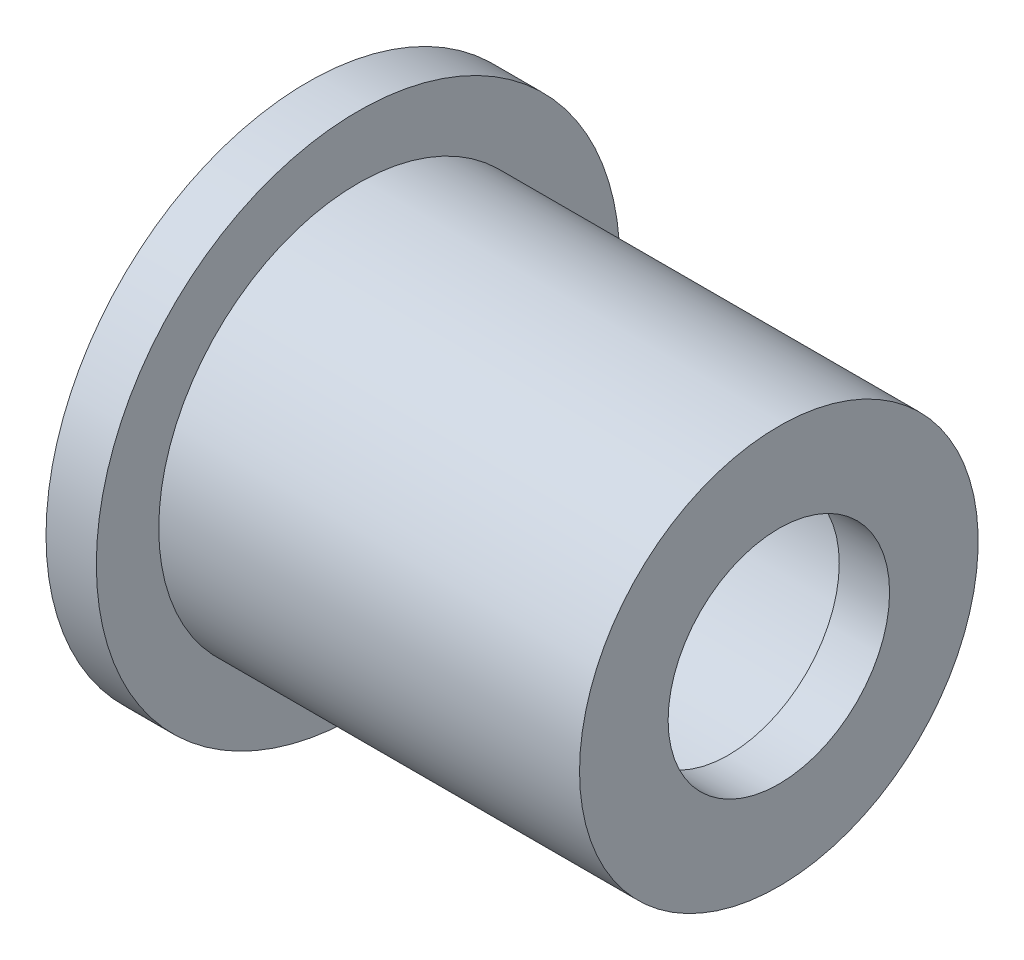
ISO-10303-21;
HEADER;
FILE_DESCRIPTION(('STEP AP214'),'2;1');
FILE_NAME('part.step','',(''),(''),'','','');
FILE_SCHEMA(('AUTOMOTIVE_DESIGN { 1 0 10303 214 1 1 1 1 }'));
ENDSEC;
DATA;
#1=APPLICATION_CONTEXT('core data for automotive mechanical design processes');
#2=APPLICATION_PROTOCOL_DEFINITION('international standard','automotive_design',2000,#1);
#3=PRODUCT_CONTEXT('',#1,'mechanical');
#4=PRODUCT('Part','Part','',(#3));
#5=PRODUCT_RELATED_PRODUCT_CATEGORY('part','',(#4));
#6=PRODUCT_DEFINITION_FORMATION('','',#4);
#7=PRODUCT_DEFINITION_CONTEXT('part definition',#1,'design');
#8=PRODUCT_DEFINITION('design','',#6,#7);
#9=PRODUCT_DEFINITION_SHAPE('','',#8);
#10=(LENGTH_UNIT() NAMED_UNIT(*) SI_UNIT(.MILLI.,.METRE.));
#11=(NAMED_UNIT(*) PLANE_ANGLE_UNIT() SI_UNIT($,.RADIAN.));
#12=(NAMED_UNIT(*) SI_UNIT($,.STERADIAN.) SOLID_ANGLE_UNIT());
#13=UNCERTAINTY_MEASURE_WITH_UNIT(LENGTH_MEASURE(1.E-05),#10,'distance_accuracy_value','');
#14=(GEOMETRIC_REPRESENTATION_CONTEXT(3) GLOBAL_UNCERTAINTY_ASSIGNED_CONTEXT((#13)) GLOBAL_UNIT_ASSIGNED_CONTEXT((#10,
#11,#12)) REPRESENTATION_CONTEXT('',''));
#15=CARTESIAN_POINT('',(0.,0.,0.));
#16=DIRECTION('',(0.,0.,1.));
#17=DIRECTION('',(1.,0.,0.));
#18=AXIS2_PLACEMENT_3D('',#15,#16,#17);
#19=CARTESIAN_POINT('',(0.,0.,0.));
#20=DIRECTION('',(-1.,0.,0.));
#21=DIRECTION('',(0.,0.,1.));
#22=AXIS2_PLACEMENT_3D('',#19,#20,#21);
#23=CYLINDRICAL_SURFACE('',#22,13.);
#24=CARTESIAN_POINT('',(0.,0.,0.));
#25=DIRECTION('',(-1.,0.,0.));
#26=DIRECTION('',(0.,0.,1.));
#27=AXIS2_PLACEMENT_3D('',#24,#25,#26);
#28=CIRCLE('',#27,13.);
#29=CARTESIAN_POINT('',(0.,0.,13.));
#30=VERTEX_POINT('',#29);
#31=EDGE_CURVE('E32',#30,#30,#28,.T.);
#32=ORIENTED_EDGE('',*,*,#31,.F.);
#33=EDGE_LOOP('',(#32));
#34=FACE_BOUND('',#33,.T.);
#35=CARTESIAN_POINT('',(2.5,0.,0.));
#36=DIRECTION('',(-1.,0.,0.));
#37=DIRECTION('',(0.,0.,1.));
#38=AXIS2_PLACEMENT_3D('',#35,#36,#37);
#39=CIRCLE('',#38,13.);
#40=CARTESIAN_POINT('',(2.5,0.,13.));
#41=VERTEX_POINT('',#40);
#42=EDGE_CURVE('E53',#41,#41,#39,.T.);
#43=ORIENTED_EDGE('',*,*,#42,.T.);
#44=EDGE_LOOP('',(#43));
#45=FACE_BOUND('',#44,.T.);
#46=ADVANCED_FACE('F22',(#34,#45),#23,.T.);
#47=CARTESIAN_POINT('',(0.,13.,0.));
#48=DIRECTION('',(1.,0.,0.));
#49=DIRECTION('',(0.,0.,-1.));
#50=AXIS2_PLACEMENT_3D('',#47,#48,#49);
#51=PLANE('',#50);
#52=CARTESIAN_POINT('',(0.,0.,0.));
#53=DIRECTION('',(1.,0.,0.));
#54=DIRECTION('',(0.,0.,-1.));
#55=AXIS2_PLACEMENT_3D('',#52,#53,#54);
#56=CIRCLE('',#55,9.00000000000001);
#57=CARTESIAN_POINT('',(0.,0.,-9.00000000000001));
#58=VERTEX_POINT('',#57);
#59=EDGE_CURVE('E10',#58,#58,#56,.T.);
#60=ORIENTED_EDGE('',*,*,#59,.T.);
#61=EDGE_LOOP('',(#60));
#62=FACE_BOUND('',#61,.T.);
#63=ORIENTED_EDGE('',*,*,#31,.T.);
#64=EDGE_LOOP('',(#63));
#65=FACE_BOUND('',#64,.T.);
#66=ADVANCED_FACE('F91',(#62,#65),#51,.F.);
#67=CARTESIAN_POINT('',(0.,0.,0.));
#68=DIRECTION('',(-1.,0.,0.));
#69=DIRECTION('',(0.,0.,1.));
#70=AXIS2_PLACEMENT_3D('',#67,#68,#69);
#71=CYLINDRICAL_SURFACE('',#70,8.);
#72=CARTESIAN_POINT('',(1.,0.,0.));
#73=DIRECTION('',(1.,0.,0.));
#74=DIRECTION('',(0.,0.,-1.));
#75=AXIS2_PLACEMENT_3D('',#72,#73,#74);
#76=CIRCLE('',#75,8.);
#77=CARTESIAN_POINT('',(1.,0.,-8.));
#78=VERTEX_POINT('',#77);
#79=EDGE_CURVE('E28',#78,#78,#76,.F.);
#80=ORIENTED_EDGE('',*,*,#79,.T.);
#81=EDGE_LOOP('',(#80));
#82=FACE_BOUND('',#81,.T.);
#83=CARTESIAN_POINT('',(20.9,0.,0.));
#84=DIRECTION('',(-1.,0.,0.));
#85=DIRECTION('',(0.,0.,1.));
#86=AXIS2_PLACEMENT_3D('',#83,#84,#85);
#87=CIRCLE('',#86,8.);
#88=CARTESIAN_POINT('',(20.9,0.,8.));
#89=VERTEX_POINT('',#88);
#90=EDGE_CURVE('E36',#89,#89,#87,.T.);
#91=ORIENTED_EDGE('',*,*,#90,.F.);
#92=EDGE_LOOP('',(#91));
#93=FACE_BOUND('',#92,.T.);
#94=ADVANCED_FACE('F86',(#82,#93),#71,.F.);
#95=CARTESIAN_POINT('',(20.9,8.,0.));
#96=DIRECTION('',(1.,0.,0.));
#97=DIRECTION('',(0.,0.,-1.));
#98=AXIS2_PLACEMENT_3D('',#95,#96,#97);
#99=PLANE('',#98);
#100=CARTESIAN_POINT('',(20.9,0.,0.));
#101=DIRECTION('',(-1.,0.,0.));
#102=DIRECTION('',(0.,0.,1.));
#103=AXIS2_PLACEMENT_3D('',#100,#101,#102);
#104=CIRCLE('',#103,5.5);
#105=CARTESIAN_POINT('',(20.9,0.,5.5));
#106=VERTEX_POINT('',#105);
#107=EDGE_CURVE('E41',#106,#106,#104,.T.);
#108=ORIENTED_EDGE('',*,*,#107,.F.);
#109=EDGE_LOOP('',(#108));
#110=FACE_BOUND('',#109,.T.);
#111=ORIENTED_EDGE('',*,*,#90,.T.);
#112=EDGE_LOOP('',(#111));
#113=FACE_BOUND('',#112,.T.);
#114=ADVANCED_FACE('F80',(#110,#113),#99,.F.);
#115=CARTESIAN_POINT('',(0.,0.,0.));
#116=DIRECTION('',(-1.,0.,0.));
#117=DIRECTION('',(0.,0.,1.));
#118=AXIS2_PLACEMENT_3D('',#115,#116,#117);
#119=CYLINDRICAL_SURFACE('',#118,5.5);
#120=CARTESIAN_POINT('',(23.4,0.,0.));
#121=DIRECTION('',(-1.,0.,0.));
#122=DIRECTION('',(0.,0.,1.));
#123=AXIS2_PLACEMENT_3D('',#120,#121,#122);
#124=CIRCLE('',#123,5.5);
#125=CARTESIAN_POINT('',(23.4,0.,5.5));
#126=VERTEX_POINT('',#125);
#127=EDGE_CURVE('E44',#126,#126,#124,.T.);
#128=ORIENTED_EDGE('',*,*,#127,.F.);
#129=EDGE_LOOP('',(#128));
#130=FACE_BOUND('',#129,.T.);
#131=ORIENTED_EDGE('',*,*,#107,.T.);
#132=EDGE_LOOP('',(#131));
#133=FACE_BOUND('',#132,.T.);
#134=ADVANCED_FACE('F74',(#130,#133),#119,.F.);
#135=CARTESIAN_POINT('',(23.4,5.5,0.));
#136=DIRECTION('',(-1.,0.,0.));
#137=DIRECTION('',(0.,0.,1.));
#138=AXIS2_PLACEMENT_3D('',#135,#136,#137);
#139=PLANE('',#138);
#140=CARTESIAN_POINT('',(23.4,0.,0.));
#141=DIRECTION('',(-1.,0.,0.));
#142=DIRECTION('',(0.,0.,1.));
#143=AXIS2_PLACEMENT_3D('',#140,#141,#142);
#144=CIRCLE('',#143,9.9);
#145=CARTESIAN_POINT('',(23.4,0.,9.9));
#146=VERTEX_POINT('',#145);
#147=EDGE_CURVE('E47',#146,#146,#144,.T.);
#148=ORIENTED_EDGE('',*,*,#147,.F.);
#149=EDGE_LOOP('',(#148));
#150=FACE_BOUND('',#149,.T.);
#151=ORIENTED_EDGE('',*,*,#127,.T.);
#152=EDGE_LOOP('',(#151));
#153=FACE_BOUND('',#152,.T.);
#154=ADVANCED_FACE('F68',(#150,#153),#139,.F.);
#155=CARTESIAN_POINT('',(0.,0.,0.));
#156=DIRECTION('',(-1.,0.,0.));
#157=DIRECTION('',(0.,0.,1.));
#158=AXIS2_PLACEMENT_3D('',#155,#156,#157);
#159=CYLINDRICAL_SURFACE('',#158,9.9);
#160=CARTESIAN_POINT('',(2.5,0.,0.));
#161=DIRECTION('',(-1.,0.,0.));
#162=DIRECTION('',(0.,0.,1.));
#163=AXIS2_PLACEMENT_3D('',#160,#161,#162);
#164=CIRCLE('',#163,9.9);
#165=CARTESIAN_POINT('',(2.5,0.,9.9));
#166=VERTEX_POINT('',#165);
#167=EDGE_CURVE('E50',#166,#166,#164,.T.);
#168=ORIENTED_EDGE('',*,*,#167,.F.);
#169=EDGE_LOOP('',(#168));
#170=FACE_BOUND('',#169,.T.);
#171=ORIENTED_EDGE('',*,*,#147,.T.);
#172=EDGE_LOOP('',(#171));
#173=FACE_BOUND('',#172,.T.);
#174=ADVANCED_FACE('F62',(#170,#173),#159,.T.);
#175=CARTESIAN_POINT('',(2.5,9.9,0.));
#176=DIRECTION('',(-1.,0.,0.));
#177=DIRECTION('',(0.,0.,1.));
#178=AXIS2_PLACEMENT_3D('',#175,#176,#177);
#179=PLANE('',#178);
#180=ORIENTED_EDGE('',*,*,#42,.F.);
#181=EDGE_LOOP('',(#180));
#182=FACE_BOUND('',#181,.T.);
#183=ORIENTED_EDGE('',*,*,#167,.T.);
#184=EDGE_LOOP('',(#183));
#185=FACE_BOUND('',#184,.T.);
#186=ADVANCED_FACE('F58',(#182,#185),#179,.F.);
#187=CARTESIAN_POINT('',(1.,0.,0.));
#188=DIRECTION('',(-1.,0.,0.));
#189=DIRECTION('',(0.,0.,1.));
#190=AXIS2_PLACEMENT_3D('',#187,#188,#189);
#191=CONICAL_SURFACE('',#190,8.,0.78539816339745);
#192=ORIENTED_EDGE('',*,*,#59,.F.);
#193=EDGE_LOOP('',(#192));
#194=FACE_BOUND('',#193,.T.);
#195=ORIENTED_EDGE('',*,*,#79,.F.);
#196=EDGE_LOOP('',(#195));
#197=FACE_BOUND('',#196,.T.);
#198=ADVANCED_FACE('F61',(#194,#197),#191,.F.);
#199=CLOSED_SHELL('',(#46,#66,#94,#114,#134,#154,#174,#186,#198));
#200=MANIFOLD_SOLID_BREP('B2',#199);
#201=ADVANCED_BREP_SHAPE_REPRESENTATION('',(#18,#200),#14);
#202=SHAPE_DEFINITION_REPRESENTATION(#9,#201);
ENDSEC;
END-ISO-10303-21;
